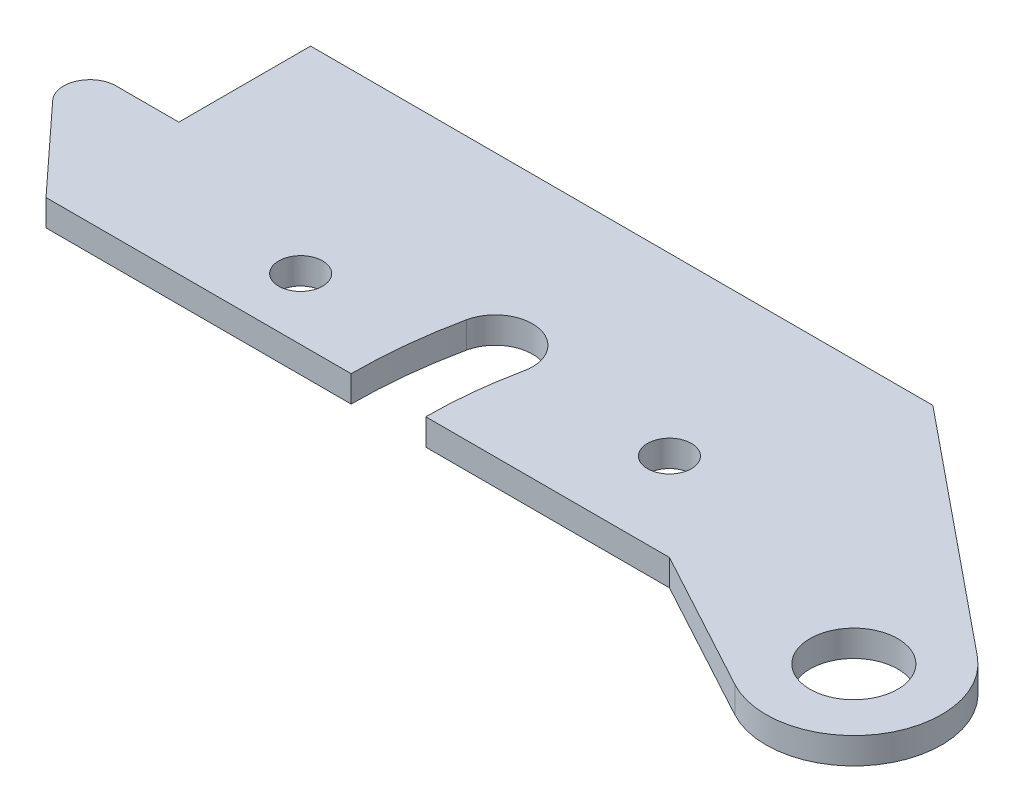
from build123d import *

# Parameters (mm, degrees)
SKETCH1_R         = 5
EXTRUDE1_DEPTH    = 3
M6_TAPPED_HOLE1_D = 5


with BuildPart() as part:
    # Sketch1 → Extrude1 (new body)
    with BuildSketch(Plane(origin=(0, 0, 0), x_dir=(1, 0, 0), z_dir=(0, 1, 0))):
        with BuildLine():
            Line((0, 0), (34.75, 0))
            ThreePointArc((34.75, 0), (35.062507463, 5.973645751), (35.996618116, 11.882075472))
            ThreePointArc((35.996618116, 11.882075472), (41.036149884, 15.157456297), (44.31153071, 10.117924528))
            ThreePointArc((44.31153071, 10.117924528), (43.516108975, 5.086728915), (43.25, 0))
            Line((43.25, 0), (71, 0))
            Line((71, 0), (87.23809524, -8.793421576))
            ThreePointArc((87.23809524, -8.793421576), (100.309970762, -5.562767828), (98.314950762, 7.753798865))
            Line((98.314950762, 7.753798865), (71, 30))
            Line((71, 30), (0.130422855, 30))
            Line((0.130422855, 30), (0.130422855, 14.997163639))
            Line((0.130422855, 14.997163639), (-6.869577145, 14.997163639))
            ThreePointArc((-6.869577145, 14.997163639), (-9.721525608, 13.262259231), (-9.203770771, 9.96446705))
            Line((-9.203770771, 9.96446705), (0, 0))
        make_face()
        with Locations(Location((92, 0, 0), (0, 0, 270))):
            Circle(SKETCH1_R, mode=Mode.SUBTRACT)
    extrude(amount=EXTRUDE1_DEPTH)

    # M6 Tapped Hole1 (through all)
    with Locations(Plane(origin=(22, 3, -7), x_dir=(0, 0, 1), z_dir=(0, 1, 0))):
        with Locations((0, 0), (-3, 39)):
            Hole(M6_TAPPED_HOLE1_D / 2)


solid = part.part
